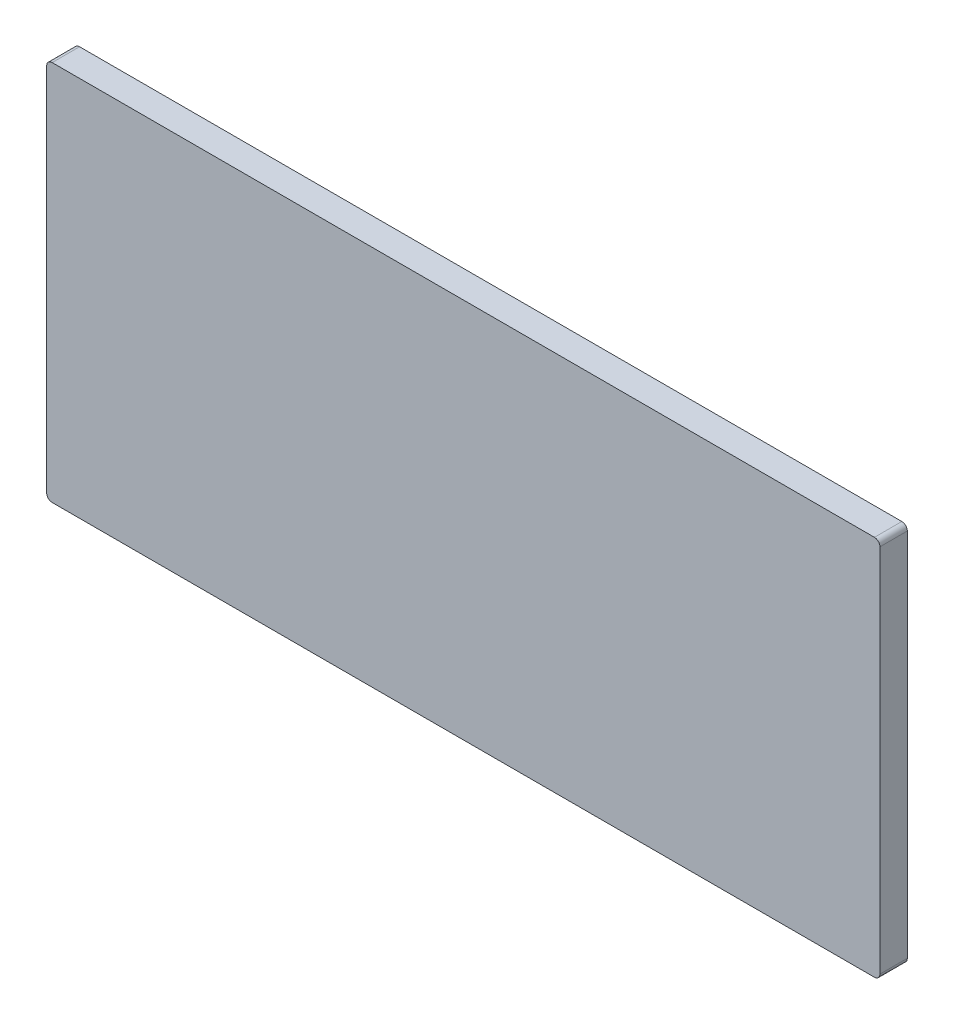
ISO-10303-21;
HEADER;
FILE_DESCRIPTION(('STEP AP214'),'2;1');
FILE_NAME('part.step','',(''),(''),'','','');
FILE_SCHEMA(('AUTOMOTIVE_DESIGN { 1 0 10303 214 1 1 1 1 }'));
ENDSEC;
DATA;
#1=APPLICATION_CONTEXT('core data for automotive mechanical design processes');
#2=APPLICATION_PROTOCOL_DEFINITION('international standard','automotive_design',2000,#1);
#3=PRODUCT_CONTEXT('',#1,'mechanical');
#4=PRODUCT('Part','Part','',(#3));
#5=PRODUCT_RELATED_PRODUCT_CATEGORY('part','',(#4));
#6=PRODUCT_DEFINITION_FORMATION('','',#4);
#7=PRODUCT_DEFINITION_CONTEXT('part definition',#1,'design');
#8=PRODUCT_DEFINITION('design','',#6,#7);
#9=PRODUCT_DEFINITION_SHAPE('','',#8);
#10=(LENGTH_UNIT() NAMED_UNIT(*) SI_UNIT(.MILLI.,.METRE.));
#11=(NAMED_UNIT(*) PLANE_ANGLE_UNIT() SI_UNIT($,.RADIAN.));
#12=(NAMED_UNIT(*) SI_UNIT($,.STERADIAN.) SOLID_ANGLE_UNIT());
#13=UNCERTAINTY_MEASURE_WITH_UNIT(LENGTH_MEASURE(1.E-05),#10,'distance_accuracy_value','');
#14=(GEOMETRIC_REPRESENTATION_CONTEXT(3) GLOBAL_UNCERTAINTY_ASSIGNED_CONTEXT((#13)) GLOBAL_UNIT_ASSIGNED_CONTEXT((#10,
#11,#12)) REPRESENTATION_CONTEXT('',''));
#15=CARTESIAN_POINT('',(0.,0.,0.));
#16=DIRECTION('',(0.,0.,1.));
#17=DIRECTION('',(1.,0.,0.));
#18=AXIS2_PLACEMENT_3D('',#15,#16,#17);
#19=CARTESIAN_POINT('',(-27.8596674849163,-28.5706119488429,10.));
#20=DIRECTION('',(0.,0.,-1.));
#21=DIRECTION('',(-1.,0.,0.));
#22=AXIS2_PLACEMENT_3D('',#19,#20,#21);
#23=CYLINDRICAL_SURFACE('',#22,2.);
#24=CARTESIAN_POINT('',(-27.8596674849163,-28.5706119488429,0.));
#25=DIRECTION('',(0.,0.,1.));
#26=DIRECTION('',(1.,0.,0.));
#27=AXIS2_PLACEMENT_3D('',#24,#25,#26);
#28=CIRCLE('',#27,2.);
#29=CARTESIAN_POINT('',(-29.8596674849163,-28.5706119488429,0.));
#30=VERTEX_POINT('',#29);
#31=CARTESIAN_POINT('',(-27.8596674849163,-30.5706119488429,0.));
#32=VERTEX_POINT('',#31);
#33=EDGE_CURVE('E128',#30,#32,#28,.T.);
#34=ORIENTED_EDGE('',*,*,#33,.T.);
#35=DIRECTION('',(0.,0.,-1.));
#36=VECTOR('',#35,1.);
#37=CARTESIAN_POINT('',(-27.8596674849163,-30.5706119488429,10.));
#38=LINE('',#37,#36);
#39=CARTESIAN_POINT('',(-27.8596674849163,-30.5706119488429,10.));
#40=VERTEX_POINT('',#39);
#41=EDGE_CURVE('E11',#40,#32,#38,.T.);
#42=ORIENTED_EDGE('',*,*,#41,.F.);
#43=CARTESIAN_POINT('',(-27.8596674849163,-28.5706119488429,10.));
#44=DIRECTION('',(0.,0.,1.));
#45=DIRECTION('',(1.,0.,0.));
#46=AXIS2_PLACEMENT_3D('',#43,#44,#45);
#47=CIRCLE('',#46,2.);
#48=CARTESIAN_POINT('',(-29.8596674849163,-28.5706119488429,10.));
#49=VERTEX_POINT('',#48);
#50=EDGE_CURVE('E142',#49,#40,#47,.T.);
#51=ORIENTED_EDGE('',*,*,#50,.F.);
#52=DIRECTION('',(0.,0.,-1.));
#53=VECTOR('',#52,1.);
#54=CARTESIAN_POINT('',(-29.8596674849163,-28.5706119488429,10.));
#55=LINE('',#54,#53);
#56=EDGE_CURVE('E124',#49,#30,#55,.T.);
#57=ORIENTED_EDGE('',*,*,#56,.T.);
#58=EDGE_LOOP('',(#34,#42,#51,#57));
#59=FACE_BOUND('',#58,.T.);
#60=ADVANCED_FACE('F32',(#59),#23,.T.);
#61=CARTESIAN_POINT('',(-27.8596674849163,-30.5706119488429,10.));
#62=DIRECTION('',(0.,1.,0.));
#63=DIRECTION('',(0.,0.,1.));
#64=AXIS2_PLACEMENT_3D('',#61,#62,#63);
#65=PLANE('',#64);
#66=DIRECTION('',(1.,0.,0.));
#67=VECTOR('',#66,1.);
#68=CARTESIAN_POINT('',(-27.8596674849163,-30.5706119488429,0.));
#69=LINE('',#68,#67);
#70=CARTESIAN_POINT('',(272.140332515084,-30.5706119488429,0.));
#71=VERTEX_POINT('',#70);
#72=EDGE_CURVE('E131',#32,#71,#69,.T.);
#73=ORIENTED_EDGE('',*,*,#72,.T.);
#74=DIRECTION('',(0.,0.,-1.));
#75=VECTOR('',#74,1.);
#76=CARTESIAN_POINT('',(272.140332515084,-30.5706119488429,10.));
#77=LINE('',#76,#75);
#78=CARTESIAN_POINT('',(272.140332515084,-30.5706119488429,10.));
#79=VERTEX_POINT('',#78);
#80=EDGE_CURVE('E40',#79,#71,#77,.T.);
#81=ORIENTED_EDGE('',*,*,#80,.F.);
#82=DIRECTION('',(1.,0.,0.));
#83=VECTOR('',#82,1.);
#84=CARTESIAN_POINT('',(-27.8596674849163,-30.5706119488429,10.));
#85=LINE('',#84,#83);
#86=EDGE_CURVE('E91',#40,#79,#85,.T.);
#87=ORIENTED_EDGE('',*,*,#86,.F.);
#88=ORIENTED_EDGE('',*,*,#41,.T.);
#89=EDGE_LOOP('',(#73,#81,#87,#88));
#90=FACE_BOUND('',#89,.T.);
#91=ADVANCED_FACE('F177',(#90),#65,.F.);
#92=CARTESIAN_POINT('',(272.140332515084,-28.5706119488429,10.));
#93=DIRECTION('',(0.,0.,-1.));
#94=DIRECTION('',(-1.,0.,0.));
#95=AXIS2_PLACEMENT_3D('',#92,#93,#94);
#96=CYLINDRICAL_SURFACE('',#95,2.);
#97=CARTESIAN_POINT('',(272.140332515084,-28.5706119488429,0.));
#98=DIRECTION('',(0.,0.,1.));
#99=DIRECTION('',(1.,0.,0.));
#100=AXIS2_PLACEMENT_3D('',#97,#98,#99);
#101=CIRCLE('',#100,2.);
#102=CARTESIAN_POINT('',(274.140332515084,-28.5706119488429,0.));
#103=VERTEX_POINT('',#102);
#104=EDGE_CURVE('E133',#71,#103,#101,.T.);
#105=ORIENTED_EDGE('',*,*,#104,.T.);
#106=DIRECTION('',(0.,0.,-1.));
#107=VECTOR('',#106,1.);
#108=CARTESIAN_POINT('',(274.140332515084,-28.5706119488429,10.));
#109=LINE('',#108,#107);
#110=CARTESIAN_POINT('',(274.140332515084,-28.5706119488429,10.));
#111=VERTEX_POINT('',#110);
#112=EDGE_CURVE('E149',#111,#103,#109,.T.);
#113=ORIENTED_EDGE('',*,*,#112,.F.);
#114=CARTESIAN_POINT('',(272.140332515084,-28.5706119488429,10.));
#115=DIRECTION('',(0.,0.,1.));
#116=DIRECTION('',(1.,0.,0.));
#117=AXIS2_PLACEMENT_3D('',#114,#115,#116);
#118=CIRCLE('',#117,2.);
#119=EDGE_CURVE('E157',#79,#111,#118,.T.);
#120=ORIENTED_EDGE('',*,*,#119,.F.);
#121=ORIENTED_EDGE('',*,*,#80,.T.);
#122=EDGE_LOOP('',(#105,#113,#120,#121));
#123=FACE_BOUND('',#122,.T.);
#124=ADVANCED_FACE('F155',(#123),#96,.T.);
#125=CARTESIAN_POINT('',(274.140332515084,106.429388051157,10.));
#126=DIRECTION('',(-1.,0.,0.));
#127=DIRECTION('',(0.,0.,1.));
#128=AXIS2_PLACEMENT_3D('',#125,#126,#127);
#129=PLANE('',#128);
#130=DIRECTION('',(0.,1.,0.));
#131=VECTOR('',#130,1.);
#132=CARTESIAN_POINT('',(274.140332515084,106.429388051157,0.));
#133=LINE('',#132,#131);
#134=CARTESIAN_POINT('',(274.140332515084,106.429388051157,0.));
#135=VERTEX_POINT('',#134);
#136=EDGE_CURVE('E135',#103,#135,#133,.T.);
#137=ORIENTED_EDGE('',*,*,#136,.T.);
#138=DIRECTION('',(0.,0.,-1.));
#139=VECTOR('',#138,1.);
#140=CARTESIAN_POINT('',(274.140332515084,106.429388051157,10.));
#141=LINE('',#140,#139);
#142=CARTESIAN_POINT('',(274.140332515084,106.429388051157,10.));
#143=VERTEX_POINT('',#142);
#144=EDGE_CURVE('E146',#143,#135,#141,.T.);
#145=ORIENTED_EDGE('',*,*,#144,.F.);
#146=DIRECTION('',(0.,1.,0.));
#147=VECTOR('',#146,1.);
#148=CARTESIAN_POINT('',(274.140332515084,106.429388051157,10.));
#149=LINE('',#148,#147);
#150=EDGE_CURVE('E169',#111,#143,#149,.T.);
#151=ORIENTED_EDGE('',*,*,#150,.F.);
#152=ORIENTED_EDGE('',*,*,#112,.T.);
#153=EDGE_LOOP('',(#137,#145,#151,#152));
#154=FACE_BOUND('',#153,.T.);
#155=ADVANCED_FACE('F165',(#154),#129,.F.);
#156=CARTESIAN_POINT('',(272.140332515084,106.429388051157,10.));
#157=DIRECTION('',(0.,0.,-1.));
#158=DIRECTION('',(-1.,0.,0.));
#159=AXIS2_PLACEMENT_3D('',#156,#157,#158);
#160=CYLINDRICAL_SURFACE('',#159,2.);
#161=CARTESIAN_POINT('',(272.140332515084,106.429388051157,0.));
#162=DIRECTION('',(0.,0.,1.));
#163=DIRECTION('',(-1.,0.,0.));
#164=AXIS2_PLACEMENT_3D('',#161,#162,#163);
#165=CIRCLE('',#164,2.);
#166=CARTESIAN_POINT('',(272.140332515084,108.429388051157,0.));
#167=VERTEX_POINT('',#166);
#168=EDGE_CURVE('E137',#135,#167,#165,.T.);
#169=ORIENTED_EDGE('',*,*,#168,.T.);
#170=DIRECTION('',(0.,0.,-1.));
#171=VECTOR('',#170,1.);
#172=CARTESIAN_POINT('',(272.140332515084,108.429388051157,10.));
#173=LINE('',#172,#171);
#174=CARTESIAN_POINT('',(272.140332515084,108.429388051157,10.));
#175=VERTEX_POINT('',#174);
#176=EDGE_CURVE('E119',#175,#167,#173,.T.);
#177=ORIENTED_EDGE('',*,*,#176,.F.);
#178=CARTESIAN_POINT('',(272.140332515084,106.429388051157,10.));
#179=DIRECTION('',(0.,0.,1.));
#180=DIRECTION('',(-1.,0.,0.));
#181=AXIS2_PLACEMENT_3D('',#178,#179,#180);
#182=CIRCLE('',#181,2.);
#183=EDGE_CURVE('E110',#143,#175,#182,.T.);
#184=ORIENTED_EDGE('',*,*,#183,.F.);
#185=ORIENTED_EDGE('',*,*,#144,.T.);
#186=EDGE_LOOP('',(#169,#177,#184,#185));
#187=FACE_BOUND('',#186,.T.);
#188=ADVANCED_FACE('F168',(#187),#160,.T.);
#189=CARTESIAN_POINT('',(-27.8596674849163,108.429388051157,10.));
#190=DIRECTION('',(0.,-1.,0.));
#191=DIRECTION('',(0.,0.,-1.));
#192=AXIS2_PLACEMENT_3D('',#189,#190,#191);
#193=PLANE('',#192);
#194=DIRECTION('',(-1.,0.,0.));
#195=VECTOR('',#194,1.);
#196=CARTESIAN_POINT('',(-27.8596674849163,108.429388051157,0.));
#197=LINE('',#196,#195);
#198=CARTESIAN_POINT('',(-27.8596674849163,108.429388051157,0.));
#199=VERTEX_POINT('',#198);
#200=EDGE_CURVE('E118',#167,#199,#197,.T.);
#201=ORIENTED_EDGE('',*,*,#200,.T.);
#202=DIRECTION('',(0.,0.,-1.));
#203=VECTOR('',#202,1.);
#204=CARTESIAN_POINT('',(-27.8596674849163,108.429388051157,10.));
#205=LINE('',#204,#203);
#206=CARTESIAN_POINT('',(-27.8596674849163,108.429388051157,10.));
#207=VERTEX_POINT('',#206);
#208=EDGE_CURVE('E115',#207,#199,#205,.T.);
#209=ORIENTED_EDGE('',*,*,#208,.F.);
#210=DIRECTION('',(-1.,0.,0.));
#211=VECTOR('',#210,1.);
#212=CARTESIAN_POINT('',(-27.8596674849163,108.429388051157,10.));
#213=LINE('',#212,#211);
#214=EDGE_CURVE('E104',#175,#207,#213,.T.);
#215=ORIENTED_EDGE('',*,*,#214,.F.);
#216=ORIENTED_EDGE('',*,*,#176,.T.);
#217=EDGE_LOOP('',(#201,#209,#215,#216));
#218=FACE_BOUND('',#217,.T.);
#219=ADVANCED_FACE('F116',(#218),#193,.F.);
#220=CARTESIAN_POINT('',(-27.8596674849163,106.429388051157,10.));
#221=DIRECTION('',(0.,0.,-1.));
#222=DIRECTION('',(-1.,0.,0.));
#223=AXIS2_PLACEMENT_3D('',#220,#221,#222);
#224=CYLINDRICAL_SURFACE('',#223,2.);
#225=CARTESIAN_POINT('',(-27.8596674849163,106.429388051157,0.));
#226=DIRECTION('',(0.,0.,1.));
#227=DIRECTION('',(1.,0.,0.));
#228=AXIS2_PLACEMENT_3D('',#225,#226,#227);
#229=CIRCLE('',#228,2.);
#230=CARTESIAN_POINT('',(-29.8596674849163,106.429388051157,0.));
#231=VERTEX_POINT('',#230);
#232=EDGE_CURVE('E77',#199,#231,#229,.T.);
#233=ORIENTED_EDGE('',*,*,#232,.T.);
#234=DIRECTION('',(0.,0.,-1.));
#235=VECTOR('',#234,1.);
#236=CARTESIAN_POINT('',(-29.8596674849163,106.429388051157,10.));
#237=LINE('',#236,#235);
#238=CARTESIAN_POINT('',(-29.8596674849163,106.429388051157,10.));
#239=VERTEX_POINT('',#238);
#240=EDGE_CURVE('E120',#239,#231,#237,.T.);
#241=ORIENTED_EDGE('',*,*,#240,.F.);
#242=CARTESIAN_POINT('',(-27.8596674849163,106.429388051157,10.));
#243=DIRECTION('',(0.,0.,1.));
#244=DIRECTION('',(1.,0.,0.));
#245=AXIS2_PLACEMENT_3D('',#242,#243,#244);
#246=CIRCLE('',#245,2.);
#247=EDGE_CURVE('E108',#207,#239,#246,.T.);
#248=ORIENTED_EDGE('',*,*,#247,.F.);
#249=ORIENTED_EDGE('',*,*,#208,.T.);
#250=EDGE_LOOP('',(#233,#241,#248,#249));
#251=FACE_BOUND('',#250,.T.);
#252=ADVANCED_FACE('F122',(#251),#224,.T.);
#253=CARTESIAN_POINT('',(-29.8596674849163,106.429388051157,10.));
#254=DIRECTION('',(1.,0.,0.));
#255=DIRECTION('',(0.,1.,0.));
#256=AXIS2_PLACEMENT_3D('',#253,#254,#255);
#257=PLANE('',#256);
#258=DIRECTION('',(0.,-1.,0.));
#259=VECTOR('',#258,1.);
#260=CARTESIAN_POINT('',(-29.8596674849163,106.429388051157,0.));
#261=LINE('',#260,#259);
#262=EDGE_CURVE('E83',#231,#30,#261,.T.);
#263=ORIENTED_EDGE('',*,*,#262,.T.);
#264=ORIENTED_EDGE('',*,*,#56,.F.);
#265=DIRECTION('',(0.,-1.,0.));
#266=VECTOR('',#265,1.);
#267=CARTESIAN_POINT('',(-29.8596674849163,106.429388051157,10.));
#268=LINE('',#267,#266);
#269=EDGE_CURVE('E48',#239,#49,#268,.T.);
#270=ORIENTED_EDGE('',*,*,#269,.F.);
#271=ORIENTED_EDGE('',*,*,#240,.T.);
#272=EDGE_LOOP('',(#263,#264,#270,#271));
#273=FACE_BOUND('',#272,.T.);
#274=ADVANCED_FACE('F193',(#273),#257,.F.);
#275=CARTESIAN_POINT('',(-27.8596674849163,-28.5706119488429,10.));
#276=DIRECTION('',(0.,0.,1.));
#277=DIRECTION('',(1.,0.,0.));
#278=AXIS2_PLACEMENT_3D('',#275,#276,#277);
#279=PLANE('',#278);
#280=ORIENTED_EDGE('',*,*,#50,.T.);
#281=ORIENTED_EDGE('',*,*,#86,.T.);
#282=ORIENTED_EDGE('',*,*,#119,.T.);
#283=ORIENTED_EDGE('',*,*,#150,.T.);
#284=ORIENTED_EDGE('',*,*,#183,.T.);
#285=ORIENTED_EDGE('',*,*,#214,.T.);
#286=ORIENTED_EDGE('',*,*,#247,.T.);
#287=ORIENTED_EDGE('',*,*,#269,.T.);
#288=EDGE_LOOP('',(#280,#281,#282,#283,#284,#285,#286,#287));
#289=FACE_BOUND('',#288,.T.);
#290=ADVANCED_FACE('F106',(#289),#279,.T.);
#291=CARTESIAN_POINT('',(-27.8596674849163,-28.5706119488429,0.));
#292=DIRECTION('',(0.,0.,1.));
#293=DIRECTION('',(1.,0.,0.));
#294=AXIS2_PLACEMENT_3D('',#291,#292,#293);
#295=PLANE('',#294);
#296=ORIENTED_EDGE('',*,*,#33,.F.);
#297=ORIENTED_EDGE('',*,*,#262,.F.);
#298=ORIENTED_EDGE('',*,*,#232,.F.);
#299=ORIENTED_EDGE('',*,*,#200,.F.);
#300=ORIENTED_EDGE('',*,*,#168,.F.);
#301=ORIENTED_EDGE('',*,*,#136,.F.);
#302=ORIENTED_EDGE('',*,*,#104,.F.);
#303=ORIENTED_EDGE('',*,*,#72,.F.);
#304=EDGE_LOOP('',(#296,#297,#298,#299,#300,#301,#302,#303));
#305=FACE_BOUND('',#304,.T.);
#306=ADVANCED_FACE('F161',(#305),#295,.F.);
#307=CLOSED_SHELL('',(#60,#91,#124,#155,#188,#219,#252,#274,#290,#306));
#308=MANIFOLD_SOLID_BREP('B2',#307);
#309=ADVANCED_BREP_SHAPE_REPRESENTATION('',(#18,#308),#14);
#310=SHAPE_DEFINITION_REPRESENTATION(#9,#309);
ENDSEC;
END-ISO-10303-21;
